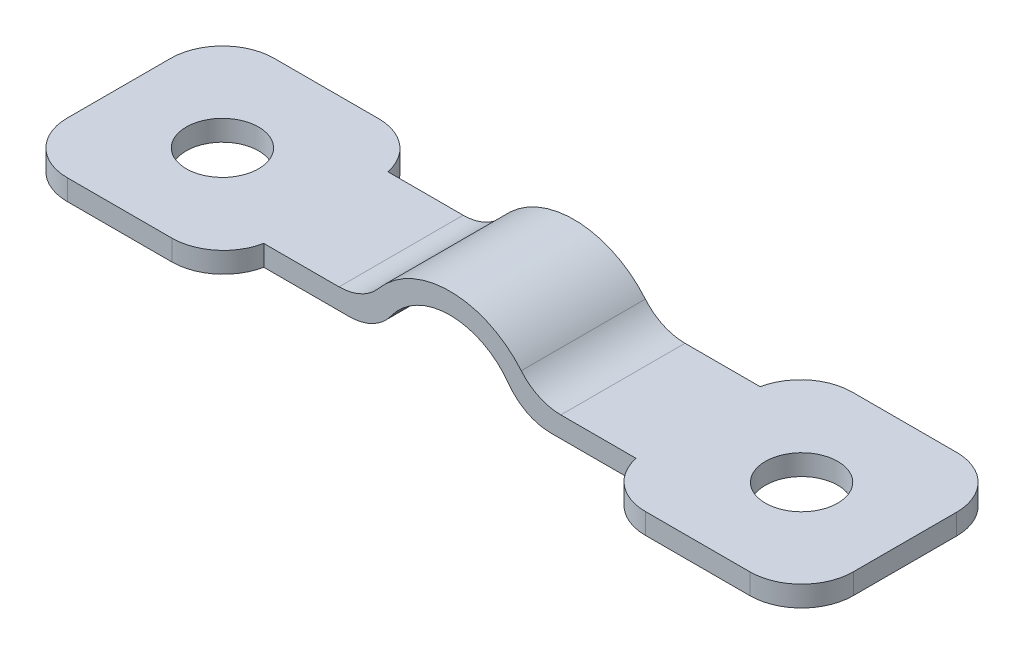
ISO-10303-21;
HEADER;
FILE_DESCRIPTION(('STEP AP214'),'2;1');
FILE_NAME('part.step','',(''),(''),'','','');
FILE_SCHEMA(('AUTOMOTIVE_DESIGN { 1 0 10303 214 1 1 1 1 }'));
ENDSEC;
DATA;
#1=APPLICATION_CONTEXT('core data for automotive mechanical design processes');
#2=APPLICATION_PROTOCOL_DEFINITION('international standard','automotive_design',2000,#1);
#3=PRODUCT_CONTEXT('',#1,'mechanical');
#4=PRODUCT('Part','Part','',(#3));
#5=PRODUCT_RELATED_PRODUCT_CATEGORY('part','',(#4));
#6=PRODUCT_DEFINITION_FORMATION('','',#4);
#7=PRODUCT_DEFINITION_CONTEXT('part definition',#1,'design');
#8=PRODUCT_DEFINITION('design','',#6,#7);
#9=PRODUCT_DEFINITION_SHAPE('','',#8);
#10=(LENGTH_UNIT() NAMED_UNIT(*) SI_UNIT(.MILLI.,.METRE.));
#11=(NAMED_UNIT(*) PLANE_ANGLE_UNIT() SI_UNIT($,.RADIAN.));
#12=(NAMED_UNIT(*) SI_UNIT($,.STERADIAN.) SOLID_ANGLE_UNIT());
#13=UNCERTAINTY_MEASURE_WITH_UNIT(LENGTH_MEASURE(1.E-05),#10,'distance_accuracy_value','');
#14=(GEOMETRIC_REPRESENTATION_CONTEXT(3) GLOBAL_UNCERTAINTY_ASSIGNED_CONTEXT((#13)) GLOBAL_UNIT_ASSIGNED_CONTEXT((#10,
#11,#12)) REPRESENTATION_CONTEXT('',''));
#15=CARTESIAN_POINT('',(0.,0.,0.));
#16=DIRECTION('',(0.,0.,1.));
#17=DIRECTION('',(1.,0.,0.));
#18=AXIS2_PLACEMENT_3D('',#15,#16,#17);
#19=CARTESIAN_POINT('',(0.,2.,10.));
#20=DIRECTION('',(0.,-1.,0.));
#21=DIRECTION('',(1.,0.,0.));
#22=AXIS2_PLACEMENT_3D('',#19,#20,#21);
#23=PLANE('',#22);
#24=CARTESIAN_POINT('',(-14.,1.99999999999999,5.));
#25=DIRECTION('',(0.,1.,0.));
#26=DIRECTION('',(-1.,0.,0.));
#27=AXIS2_PLACEMENT_3D('',#24,#25,#26);
#28=CIRCLE('',#27,1.75);
#29=CARTESIAN_POINT('',(-15.75,1.99999999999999,5.));
#30=VERTEX_POINT('',#29);
#31=EDGE_CURVE('E604',#30,#30,#28,.T.);
#32=ORIENTED_EDGE('',*,*,#31,.F.);
#33=EDGE_LOOP('',(#32));
#34=FACE_BOUND('',#33,.T.);
#35=DIRECTION('',(-1.,0.,0.));
#36=VECTOR('',#35,1.);
#37=CARTESIAN_POINT('',(0.,2.,10.));
#38=LINE('',#37,#36);
#39=CARTESIAN_POINT('',(-11.4494897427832,1.99999999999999,10.));
#40=VERTEX_POINT('',#39);
#41=CARTESIAN_POINT('',(-16.5,1.99999999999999,10.));
#42=VERTEX_POINT('',#41);
#43=EDGE_CURVE('E311',#40,#42,#38,.T.);
#44=ORIENTED_EDGE('',*,*,#43,.F.);
#45=CARTESIAN_POINT('',(-11.4494897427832,1.99999999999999,7.5));
#46=DIRECTION('',(0.,-1.,0.));
#47=DIRECTION('',(1.,0.,0.));
#48=AXIS2_PLACEMENT_3D('',#45,#46,#47);
#49=CIRCLE('',#48,2.5);
#50=CARTESIAN_POINT('',(-9.,1.99999999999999,8.));
#51=VERTEX_POINT('',#50);
#52=EDGE_CURVE('E89',#40,#51,#49,.F.);
#53=ORIENTED_EDGE('',*,*,#52,.T.);
#54=DIRECTION('',(-1.,0.,0.));
#55=VECTOR('',#54,1.);
#56=CARTESIAN_POINT('',(0.,2.,8.));
#57=LINE('',#56,#55);
#58=CARTESIAN_POINT('',(-5.36190264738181,1.99999999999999,8.));
#59=VERTEX_POINT('',#58);
#60=EDGE_CURVE('E292',#59,#51,#57,.T.);
#61=ORIENTED_EDGE('',*,*,#60,.F.);
#62=DIRECTION('',(0.,0.,1.));
#63=VECTOR('',#62,1.);
#64=CARTESIAN_POINT('',(-5.36190264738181,1.99999999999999,2.));
#65=LINE('',#64,#63);
#66=CARTESIAN_POINT('',(-5.36190264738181,1.99999999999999,2.));
#67=VERTEX_POINT('',#66);
#68=EDGE_CURVE('E460',#59,#67,#65,.F.);
#69=ORIENTED_EDGE('',*,*,#68,.T.);
#70=DIRECTION('',(-1.,0.,0.));
#71=VECTOR('',#70,1.);
#72=CARTESIAN_POINT('',(0.,2.,2.));
#73=LINE('',#72,#71);
#74=CARTESIAN_POINT('',(-9.,1.99999999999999,2.));
#75=VERTEX_POINT('',#74);
#76=EDGE_CURVE('E304',#67,#75,#73,.T.);
#77=ORIENTED_EDGE('',*,*,#76,.T.);
#78=CARTESIAN_POINT('',(-11.4494897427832,1.99999999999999,2.5));
#79=DIRECTION('',(0.,-1.,0.));
#80=DIRECTION('',(1.,0.,0.));
#81=AXIS2_PLACEMENT_3D('',#78,#79,#80);
#82=CIRCLE('',#81,2.5);
#83=CARTESIAN_POINT('',(-11.4494897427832,1.99999999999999,0.));
#84=VERTEX_POINT('',#83);
#85=EDGE_CURVE('E268',#75,#84,#82,.F.);
#86=ORIENTED_EDGE('',*,*,#85,.T.);
#87=DIRECTION('',(-1.,0.,0.));
#88=VECTOR('',#87,1.);
#89=CARTESIAN_POINT('',(0.,2.,0.));
#90=LINE('',#89,#88);
#91=CARTESIAN_POINT('',(-16.5,1.99999999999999,0.));
#92=VERTEX_POINT('',#91);
#93=EDGE_CURVE('E318',#84,#92,#90,.T.);
#94=ORIENTED_EDGE('',*,*,#93,.T.);
#95=CARTESIAN_POINT('',(-16.5,1.99999999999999,2.5));
#96=DIRECTION('',(0.,-1.,0.));
#97=DIRECTION('',(1.,0.,0.));
#98=AXIS2_PLACEMENT_3D('',#95,#96,#97);
#99=CIRCLE('',#98,2.5);
#100=CARTESIAN_POINT('',(-19.,1.99999999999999,2.5));
#101=VERTEX_POINT('',#100);
#102=EDGE_CURVE('E401',#92,#101,#99,.F.);
#103=ORIENTED_EDGE('',*,*,#102,.T.);
#104=DIRECTION('',(0.,0.,-1.));
#105=VECTOR('',#104,1.);
#106=CARTESIAN_POINT('',(-19.,1.99999999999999,10.));
#107=LINE('',#106,#105);
#108=CARTESIAN_POINT('',(-19.,1.99999999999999,7.5));
#109=VERTEX_POINT('',#108);
#110=EDGE_CURVE('E328',#109,#101,#107,.T.);
#111=ORIENTED_EDGE('',*,*,#110,.F.);
#112=CARTESIAN_POINT('',(-16.5,1.99999999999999,7.5));
#113=DIRECTION('',(0.,-1.,0.));
#114=DIRECTION('',(1.,0.,0.));
#115=AXIS2_PLACEMENT_3D('',#112,#113,#114);
#116=CIRCLE('',#115,2.5);
#117=EDGE_CURVE('E397',#109,#42,#116,.F.);
#118=ORIENTED_EDGE('',*,*,#117,.T.);
#119=EDGE_LOOP('',(#44,#53,#61,#69,#77,#86,#94,#103,#111,#118));
#120=FACE_BOUND('',#119,.T.);
#121=ADVANCED_FACE('F80',(#34,#120),#23,.F.);
#122=CARTESIAN_POINT('',(0.,0.999999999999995,10.));
#123=DIRECTION('',(0.,-1.,0.));
#124=DIRECTION('',(1.,0.,0.));
#125=AXIS2_PLACEMENT_3D('',#122,#123,#124);
#126=PLANE('',#125);
#127=CARTESIAN_POINT('',(-14.,0.999999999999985,5.));
#128=DIRECTION('',(0.,1.,0.));
#129=DIRECTION('',(-1.,0.,0.));
#130=AXIS2_PLACEMENT_3D('',#127,#128,#129);
#131=CIRCLE('',#130,1.75);
#132=CARTESIAN_POINT('',(-15.75,0.999999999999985,5.));
#133=VERTEX_POINT('',#132);
#134=EDGE_CURVE('E601',#133,#133,#131,.T.);
#135=ORIENTED_EDGE('',*,*,#134,.T.);
#136=EDGE_LOOP('',(#135));
#137=FACE_BOUND('',#136,.T.);
#138=DIRECTION('',(1.,0.,0.));
#139=VECTOR('',#138,1.);
#140=CARTESIAN_POINT('',(0.,0.99999999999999,8.));
#141=LINE('',#140,#139);
#142=CARTESIAN_POINT('',(-9.,0.999999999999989,8.));
#143=VERTEX_POINT('',#142);
#144=CARTESIAN_POINT('',(-4.87339717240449,0.99999999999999,8.));
#145=VERTEX_POINT('',#144);
#146=EDGE_CURVE('E277',#143,#145,#141,.T.);
#147=ORIENTED_EDGE('',*,*,#146,.F.);
#148=CARTESIAN_POINT('',(-11.4494897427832,0.999999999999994,7.5));
#149=DIRECTION('',(0.,-1.,0.));
#150=DIRECTION('',(1.,0.,0.));
#151=AXIS2_PLACEMENT_3D('',#148,#149,#150);
#152=CIRCLE('',#151,2.5);
#153=CARTESIAN_POINT('',(-11.4494897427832,0.999999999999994,10.));
#154=VERTEX_POINT('',#153);
#155=EDGE_CURVE('E12',#143,#154,#152,.T.);
#156=ORIENTED_EDGE('',*,*,#155,.T.);
#157=DIRECTION('',(-1.,0.,0.));
#158=VECTOR('',#157,1.);
#159=CARTESIAN_POINT('',(0.,0.999999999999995,10.));
#160=LINE('',#159,#158);
#161=CARTESIAN_POINT('',(-16.5,0.999999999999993,10.));
#162=VERTEX_POINT('',#161);
#163=EDGE_CURVE('E314',#154,#162,#160,.T.);
#164=ORIENTED_EDGE('',*,*,#163,.T.);
#165=CARTESIAN_POINT('',(-16.5,0.999999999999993,7.5));
#166=DIRECTION('',(0.,-1.,0.));
#167=DIRECTION('',(1.,0.,0.));
#168=AXIS2_PLACEMENT_3D('',#165,#166,#167);
#169=CIRCLE('',#168,2.5);
#170=CARTESIAN_POINT('',(-19.,0.999999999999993,7.5));
#171=VERTEX_POINT('',#170);
#172=EDGE_CURVE('E413',#162,#171,#169,.T.);
#173=ORIENTED_EDGE('',*,*,#172,.T.);
#174=DIRECTION('',(0.,0.,-1.));
#175=VECTOR('',#174,1.);
#176=CARTESIAN_POINT('',(-19.,0.999999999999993,10.));
#177=LINE('',#176,#175);
#178=CARTESIAN_POINT('',(-19.,0.999999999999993,2.5));
#179=VERTEX_POINT('',#178);
#180=EDGE_CURVE('E317',#171,#179,#177,.T.);
#181=ORIENTED_EDGE('',*,*,#180,.T.);
#182=CARTESIAN_POINT('',(-16.5,0.999999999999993,2.5));
#183=DIRECTION('',(0.,-1.,0.));
#184=DIRECTION('',(1.,0.,0.));
#185=AXIS2_PLACEMENT_3D('',#182,#183,#184);
#186=CIRCLE('',#185,2.5);
#187=CARTESIAN_POINT('',(-16.5,0.999999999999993,0.));
#188=VERTEX_POINT('',#187);
#189=EDGE_CURVE('E253',#179,#188,#186,.T.);
#190=ORIENTED_EDGE('',*,*,#189,.T.);
#191=DIRECTION('',(-1.,0.,0.));
#192=VECTOR('',#191,1.);
#193=CARTESIAN_POINT('',(0.,0.999999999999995,0.));
#194=LINE('',#193,#192);
#195=CARTESIAN_POINT('',(-11.4494897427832,0.999999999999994,0.));
#196=VERTEX_POINT('',#195);
#197=EDGE_CURVE('E247',#196,#188,#194,.T.);
#198=ORIENTED_EDGE('',*,*,#197,.F.);
#199=CARTESIAN_POINT('',(-11.4494897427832,0.999999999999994,2.5));
#200=DIRECTION('',(0.,-1.,0.));
#201=DIRECTION('',(1.,0.,0.));
#202=AXIS2_PLACEMENT_3D('',#199,#200,#201);
#203=CIRCLE('',#202,2.5);
#204=CARTESIAN_POINT('',(-9.,0.999999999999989,2.));
#205=VERTEX_POINT('',#204);
#206=EDGE_CURVE('E241',#196,#205,#203,.T.);
#207=ORIENTED_EDGE('',*,*,#206,.T.);
#208=DIRECTION('',(1.,0.,0.));
#209=VECTOR('',#208,1.);
#210=CARTESIAN_POINT('',(0.,0.99999999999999,2.));
#211=LINE('',#210,#209);
#212=CARTESIAN_POINT('',(-4.87339717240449,0.99999999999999,2.));
#213=VERTEX_POINT('',#212);
#214=EDGE_CURVE('E244',#205,#213,#211,.T.);
#215=ORIENTED_EDGE('',*,*,#214,.T.);
#216=DIRECTION('',(0.,0.,-1.));
#217=VECTOR('',#216,1.);
#218=CARTESIAN_POINT('',(-4.87339717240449,0.999999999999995,10.));
#219=LINE('',#218,#217);
#220=EDGE_CURVE('E464',#213,#145,#219,.F.);
#221=ORIENTED_EDGE('',*,*,#220,.T.);
#222=EDGE_LOOP('',(#147,#156,#164,#173,#181,#190,#198,#207,#215,#221));
#223=FACE_BOUND('',#222,.T.);
#224=ADVANCED_FACE('F243',(#137,#223),#126,.T.);
#225=CARTESIAN_POINT('',(0.,0.,10.));
#226=DIRECTION('',(0.,0.,-1.));
#227=DIRECTION('',(-1.,0.,0.));
#228=AXIS2_PLACEMENT_3D('',#225,#226,#227);
#229=CYLINDRICAL_SURFACE('',#228,3.5);
#230=CARTESIAN_POINT('',(0.,0.,2.));
#231=DIRECTION('',(0.,0.,1.));
#232=DIRECTION('',(1.,0.,0.));
#233=AXIS2_PLACEMENT_3D('',#230,#231,#232);
#234=CIRCLE('',#233,3.5);
#235=CARTESIAN_POINT('',(2.84281501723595,2.04166666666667,2.));
#236=VERTEX_POINT('',#235);
#237=CARTESIAN_POINT('',(-2.84281501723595,2.04166666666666,2.));
#238=VERTEX_POINT('',#237);
#239=EDGE_CURVE('E307',#236,#238,#234,.T.);
#240=ORIENTED_EDGE('',*,*,#239,.F.);
#241=DIRECTION('',(0.,0.,-1.));
#242=VECTOR('',#241,1.);
#243=CARTESIAN_POINT('',(2.84281501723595,2.04166666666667,10.));
#244=LINE('',#243,#242);
#245=CARTESIAN_POINT('',(2.84281501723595,2.04166666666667,8.));
#246=VERTEX_POINT('',#245);
#247=EDGE_CURVE('E441',#236,#246,#244,.F.);
#248=ORIENTED_EDGE('',*,*,#247,.T.);
#249=CARTESIAN_POINT('',(0.,0.,8.));
#250=DIRECTION('',(0.,0.,1.));
#251=DIRECTION('',(1.,0.,0.));
#252=AXIS2_PLACEMENT_3D('',#249,#250,#251);
#253=CIRCLE('',#252,3.5);
#254=CARTESIAN_POINT('',(-2.84281501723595,2.04166666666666,8.));
#255=VERTEX_POINT('',#254);
#256=EDGE_CURVE('E296',#246,#255,#253,.T.);
#257=ORIENTED_EDGE('',*,*,#256,.T.);
#258=DIRECTION('',(0.,0.,-1.));
#259=VECTOR('',#258,1.);
#260=CARTESIAN_POINT('',(-2.84281501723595,2.04166666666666,10.));
#261=LINE('',#260,#259);
#262=EDGE_CURVE('E437',#255,#238,#261,.T.);
#263=ORIENTED_EDGE('',*,*,#262,.T.);
#264=EDGE_LOOP('',(#240,#248,#257,#263));
#265=FACE_BOUND('',#264,.T.);
#266=ADVANCED_FACE('F546',(#265),#229,.F.);
#267=CARTESIAN_POINT('',(0.,0.,10.));
#268=DIRECTION('',(0.,0.,-1.));
#269=DIRECTION('',(-1.,0.,0.));
#270=AXIS2_PLACEMENT_3D('',#267,#268,#269);
#271=CYLINDRICAL_SURFACE('',#270,4.5);
#272=CARTESIAN_POINT('',(0.,0.,8.));
#273=DIRECTION('',(0.,0.,1.));
#274=DIRECTION('',(1.,0.,0.));
#275=AXIS2_PLACEMENT_3D('',#272,#273,#274);
#276=CIRCLE('',#275,4.5);
#277=CARTESIAN_POINT('',(3.44693741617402,2.89285714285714,8.));
#278=VERTEX_POINT('',#277);
#279=CARTESIAN_POINT('',(-3.44693741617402,2.89285714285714,8.));
#280=VERTEX_POINT('',#279);
#281=EDGE_CURVE('E274',#278,#280,#276,.T.);
#282=ORIENTED_EDGE('',*,*,#281,.F.);
#283=DIRECTION('',(0.,0.,-1.));
#284=VECTOR('',#283,1.);
#285=CARTESIAN_POINT('',(3.44693741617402,2.89285714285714,10.));
#286=LINE('',#285,#284);
#287=CARTESIAN_POINT('',(3.44693741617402,2.89285714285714,2.));
#288=VERTEX_POINT('',#287);
#289=EDGE_CURVE('E453',#278,#288,#286,.T.);
#290=ORIENTED_EDGE('',*,*,#289,.T.);
#291=CARTESIAN_POINT('',(0.,0.,2.));
#292=DIRECTION('',(0.,0.,1.));
#293=DIRECTION('',(1.,0.,0.));
#294=AXIS2_PLACEMENT_3D('',#291,#292,#293);
#295=CIRCLE('',#294,4.5);
#296=CARTESIAN_POINT('',(-3.44693741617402,2.89285714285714,2.));
#297=VERTEX_POINT('',#296);
#298=EDGE_CURVE('E300',#288,#297,#295,.T.);
#299=ORIENTED_EDGE('',*,*,#298,.T.);
#300=DIRECTION('',(0.,0.,-1.));
#301=VECTOR('',#300,1.);
#302=CARTESIAN_POINT('',(-3.44693741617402,2.89285714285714,10.));
#303=LINE('',#302,#301);
#304=EDGE_CURVE('E450',#297,#280,#303,.F.);
#305=ORIENTED_EDGE('',*,*,#304,.T.);
#306=EDGE_LOOP('',(#282,#290,#299,#305));
#307=FACE_BOUND('',#306,.T.);
#308=ADVANCED_FACE('F523',(#307),#271,.T.);
#309=CARTESIAN_POINT('',(0.,0.,0.));
#310=DIRECTION('',(0.,0.,1.));
#311=DIRECTION('',(1.,0.,0.));
#312=AXIS2_PLACEMENT_3D('',#309,#310,#311);
#313=PLANE('',#312);
#314=ORIENTED_EDGE('',*,*,#93,.F.);
#315=DIRECTION('',(0.,-1.,0.));
#316=VECTOR('',#315,1.);
#317=CARTESIAN_POINT('',(-11.4494897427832,0.,0.));
#318=LINE('',#317,#316);
#319=EDGE_CURVE('E410',#84,#196,#318,.T.);
#320=ORIENTED_EDGE('',*,*,#319,.T.);
#321=ORIENTED_EDGE('',*,*,#197,.T.);
#322=DIRECTION('',(0.,1.,0.));
#323=VECTOR('',#322,1.);
#324=CARTESIAN_POINT('',(-16.5,1.99999999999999,0.));
#325=LINE('',#324,#323);
#326=EDGE_CURVE('E406',#188,#92,#325,.T.);
#327=ORIENTED_EDGE('',*,*,#326,.T.);
#328=EDGE_LOOP('',(#314,#320,#321,#327));
#329=FACE_BOUND('',#328,.T.);
#330=ADVANCED_FACE('F517',(#329),#313,.F.);
#331=CARTESIAN_POINT('',(0.,0.,10.));
#332=DIRECTION('',(0.,0.,1.));
#333=DIRECTION('',(1.,0.,0.));
#334=AXIS2_PLACEMENT_3D('',#331,#332,#333);
#335=PLANE('',#334);
#336=ORIENTED_EDGE('',*,*,#163,.F.);
#337=DIRECTION('',(0.,1.,0.));
#338=VECTOR('',#337,1.);
#339=CARTESIAN_POINT('',(-11.4494897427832,1.99999999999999,10.));
#340=LINE('',#339,#338);
#341=EDGE_CURVE('E488',#154,#40,#340,.T.);
#342=ORIENTED_EDGE('',*,*,#341,.T.);
#343=ORIENTED_EDGE('',*,*,#43,.T.);
#344=DIRECTION('',(0.,1.,0.));
#345=VECTOR('',#344,1.);
#346=CARTESIAN_POINT('',(-16.5,0.,10.));
#347=LINE('',#346,#345);
#348=EDGE_CURVE('E424',#42,#162,#347,.F.);
#349=ORIENTED_EDGE('',*,*,#348,.T.);
#350=EDGE_LOOP('',(#336,#342,#343,#349));
#351=FACE_BOUND('',#350,.T.);
#352=ADVANCED_FACE('F500',(#351),#335,.T.);
#353=CARTESIAN_POINT('',(3.35410196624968,1.,10.));
#354=DIRECTION('',(0.,1.,0.));
#355=DIRECTION('',(0.,0.,1.));
#356=AXIS2_PLACEMENT_3D('',#353,#354,#355);
#357=PLANE('',#356);
#358=CARTESIAN_POINT('',(14.,0.999999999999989,5.));
#359=DIRECTION('',(0.,1.,0.));
#360=DIRECTION('',(-1.,0.,0.));
#361=AXIS2_PLACEMENT_3D('',#358,#359,#360);
#362=CIRCLE('',#361,1.75);
#363=CARTESIAN_POINT('',(12.25,0.999999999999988,5.));
#364=VERTEX_POINT('',#363);
#365=EDGE_CURVE('E615',#364,#364,#362,.T.);
#366=ORIENTED_EDGE('',*,*,#365,.T.);
#367=EDGE_LOOP('',(#366));
#368=FACE_BOUND('',#367,.T.);
#369=DIRECTION('',(1.,0.,0.));
#370=VECTOR('',#369,1.);
#371=CARTESIAN_POINT('',(3.35410196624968,1.,10.));
#372=LINE('',#371,#370);
#373=CARTESIAN_POINT('',(11.4494897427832,1.,10.));
#374=VERTEX_POINT('',#373);
#375=CARTESIAN_POINT('',(16.5,1.,10.));
#376=VERTEX_POINT('',#375);
#377=EDGE_CURVE('E336',#374,#376,#372,.T.);
#378=ORIENTED_EDGE('',*,*,#377,.F.);
#379=CARTESIAN_POINT('',(11.4494897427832,1.,7.5));
#380=DIRECTION('',(0.,1.,0.));
#381=DIRECTION('',(0.,0.,1.));
#382=AXIS2_PLACEMENT_3D('',#379,#380,#381);
#383=CIRCLE('',#382,2.5);
#384=CARTESIAN_POINT('',(9.,0.999999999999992,8.));
#385=VERTEX_POINT('',#384);
#386=EDGE_CURVE('E485',#374,#385,#383,.F.);
#387=ORIENTED_EDGE('',*,*,#386,.T.);
#388=CARTESIAN_POINT('',(4.87339717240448,0.999999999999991,8.));
#389=VERTEX_POINT('',#388);
#390=EDGE_CURVE('E282',#389,#385,#141,.T.);
#391=ORIENTED_EDGE('',*,*,#390,.F.);
#392=DIRECTION('',(0.,0.,1.));
#393=VECTOR('',#392,1.);
#394=CARTESIAN_POINT('',(4.87339717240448,1.,2.));
#395=LINE('',#394,#393);
#396=CARTESIAN_POINT('',(4.87339717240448,0.999999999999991,2.));
#397=VERTEX_POINT('',#396);
#398=EDGE_CURVE('E428',#389,#397,#395,.F.);
#399=ORIENTED_EDGE('',*,*,#398,.T.);
#400=CARTESIAN_POINT('',(9.,0.999999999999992,2.));
#401=VERTEX_POINT('',#400);
#402=EDGE_CURVE('E264',#397,#401,#211,.T.);
#403=ORIENTED_EDGE('',*,*,#402,.T.);
#404=CARTESIAN_POINT('',(11.4494897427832,1.,2.5));
#405=DIRECTION('',(0.,1.,0.));
#406=DIRECTION('',(0.,0.,1.));
#407=AXIS2_PLACEMENT_3D('',#404,#405,#406);
#408=CIRCLE('',#407,2.5);
#409=CARTESIAN_POINT('',(11.4494897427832,1.,0.));
#410=VERTEX_POINT('',#409);
#411=EDGE_CURVE('E380',#401,#410,#408,.F.);
#412=ORIENTED_EDGE('',*,*,#411,.T.);
#413=DIRECTION('',(1.,0.,0.));
#414=VECTOR('',#413,1.);
#415=CARTESIAN_POINT('',(3.35410196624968,1.,0.));
#416=LINE('',#415,#414);
#417=CARTESIAN_POINT('',(16.5,1.,0.));
#418=VERTEX_POINT('',#417);
#419=EDGE_CURVE('E337',#410,#418,#416,.T.);
#420=ORIENTED_EDGE('',*,*,#419,.T.);
#421=CARTESIAN_POINT('',(16.5,1.,2.5));
#422=DIRECTION('',(0.,1.,0.));
#423=DIRECTION('',(0.,0.,1.));
#424=AXIS2_PLACEMENT_3D('',#421,#422,#423);
#425=CIRCLE('',#424,2.5);
#426=CARTESIAN_POINT('',(19.,1.,2.5));
#427=VERTEX_POINT('',#426);
#428=EDGE_CURVE('E383',#418,#427,#425,.F.);
#429=ORIENTED_EDGE('',*,*,#428,.T.);
#430=DIRECTION('',(0.,0.,-1.));
#431=VECTOR('',#430,1.);
#432=CARTESIAN_POINT('',(19.,1.,10.));
#433=LINE('',#432,#431);
#434=CARTESIAN_POINT('',(19.,1.,7.5));
#435=VERTEX_POINT('',#434);
#436=EDGE_CURVE('E322',#435,#427,#433,.T.);
#437=ORIENTED_EDGE('',*,*,#436,.F.);
#438=CARTESIAN_POINT('',(16.5,1.,7.5));
#439=DIRECTION('',(0.,1.,0.));
#440=DIRECTION('',(0.,0.,1.));
#441=AXIS2_PLACEMENT_3D('',#438,#439,#440);
#442=CIRCLE('',#441,2.5);
#443=EDGE_CURVE('E386',#435,#376,#442,.F.);
#444=ORIENTED_EDGE('',*,*,#443,.T.);
#445=EDGE_LOOP('',(#378,#387,#391,#399,#403,#412,#420,#429,#437,#444));
#446=FACE_BOUND('',#445,.T.);
#447=ADVANCED_FACE('F554',(#368,#446),#357,.F.);
#448=CARTESIAN_POINT('',(3.35410196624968,2.,10.));
#449=DIRECTION('',(0.,1.,0.));
#450=DIRECTION('',(0.,0.,1.));
#451=AXIS2_PLACEMENT_3D('',#448,#449,#450);
#452=PLANE('',#451);
#453=CARTESIAN_POINT('',(14.,2.,5.));
#454=DIRECTION('',(0.,1.,0.));
#455=DIRECTION('',(-1.,0.,0.));
#456=AXIS2_PLACEMENT_3D('',#453,#454,#455);
#457=CIRCLE('',#456,1.75);
#458=CARTESIAN_POINT('',(12.25,2.,5.));
#459=VERTEX_POINT('',#458);
#460=EDGE_CURVE('E609',#459,#459,#457,.T.);
#461=ORIENTED_EDGE('',*,*,#460,.F.);
#462=EDGE_LOOP('',(#461));
#463=FACE_BOUND('',#462,.T.);
#464=DIRECTION('',(1.,0.,0.));
#465=VECTOR('',#464,1.);
#466=CARTESIAN_POINT('',(3.35410196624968,2.,8.));
#467=LINE('',#466,#465);
#468=CARTESIAN_POINT('',(5.3619026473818,2.,8.));
#469=VERTEX_POINT('',#468);
#470=CARTESIAN_POINT('',(9.,2.,8.));
#471=VERTEX_POINT('',#470);
#472=EDGE_CURVE('E332',#469,#471,#467,.T.);
#473=ORIENTED_EDGE('',*,*,#472,.T.);
#474=CARTESIAN_POINT('',(11.4494897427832,2.,7.5));
#475=DIRECTION('',(0.,1.,0.));
#476=DIRECTION('',(0.,0.,1.));
#477=AXIS2_PLACEMENT_3D('',#474,#475,#476);
#478=CIRCLE('',#477,2.5);
#479=CARTESIAN_POINT('',(11.4494897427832,2.,10.));
#480=VERTEX_POINT('',#479);
#481=EDGE_CURVE('E479',#471,#480,#478,.T.);
#482=ORIENTED_EDGE('',*,*,#481,.T.);
#483=DIRECTION('',(1.,0.,0.));
#484=VECTOR('',#483,1.);
#485=CARTESIAN_POINT('',(3.35410196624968,2.,10.));
#486=LINE('',#485,#484);
#487=CARTESIAN_POINT('',(16.5,2.,10.));
#488=VERTEX_POINT('',#487);
#489=EDGE_CURVE('E333',#480,#488,#486,.T.);
#490=ORIENTED_EDGE('',*,*,#489,.T.);
#491=CARTESIAN_POINT('',(16.5,2.,7.5));
#492=DIRECTION('',(0.,1.,0.));
#493=DIRECTION('',(0.,0.,1.));
#494=AXIS2_PLACEMENT_3D('',#491,#492,#493);
#495=CIRCLE('',#494,2.5);
#496=CARTESIAN_POINT('',(19.,2.,7.5));
#497=VERTEX_POINT('',#496);
#498=EDGE_CURVE('E370',#488,#497,#495,.T.);
#499=ORIENTED_EDGE('',*,*,#498,.T.);
#500=DIRECTION('',(0.,0.,-1.));
#501=VECTOR('',#500,1.);
#502=CARTESIAN_POINT('',(19.,2.,10.));
#503=LINE('',#502,#501);
#504=CARTESIAN_POINT('',(19.,2.,2.5));
#505=VERTEX_POINT('',#504);
#506=EDGE_CURVE('E340',#497,#505,#503,.T.);
#507=ORIENTED_EDGE('',*,*,#506,.T.);
#508=CARTESIAN_POINT('',(16.5,2.,2.5));
#509=DIRECTION('',(0.,1.,0.));
#510=DIRECTION('',(0.,0.,1.));
#511=AXIS2_PLACEMENT_3D('',#508,#509,#510);
#512=CIRCLE('',#511,2.5);
#513=CARTESIAN_POINT('',(16.5,2.,0.));
#514=VERTEX_POINT('',#513);
#515=EDGE_CURVE('E367',#505,#514,#512,.T.);
#516=ORIENTED_EDGE('',*,*,#515,.T.);
#517=DIRECTION('',(1.,0.,0.));
#518=VECTOR('',#517,1.);
#519=CARTESIAN_POINT('',(3.35410196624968,2.,0.));
#520=LINE('',#519,#518);
#521=CARTESIAN_POINT('',(11.4494897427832,2.,0.));
#522=VERTEX_POINT('',#521);
#523=EDGE_CURVE('E310',#522,#514,#520,.T.);
#524=ORIENTED_EDGE('',*,*,#523,.F.);
#525=CARTESIAN_POINT('',(11.4494897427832,2.,2.5));
#526=DIRECTION('',(0.,1.,0.));
#527=DIRECTION('',(0.,0.,1.));
#528=AXIS2_PLACEMENT_3D('',#525,#526,#527);
#529=CIRCLE('',#528,2.5);
#530=CARTESIAN_POINT('',(9.,2.,2.));
#531=VERTEX_POINT('',#530);
#532=EDGE_CURVE('E363',#522,#531,#529,.T.);
#533=ORIENTED_EDGE('',*,*,#532,.T.);
#534=DIRECTION('',(1.,0.,0.));
#535=VECTOR('',#534,1.);
#536=CARTESIAN_POINT('',(3.35410196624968,2.,2.));
#537=LINE('',#536,#535);
#538=CARTESIAN_POINT('',(5.3619026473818,2.,2.));
#539=VERTEX_POINT('',#538);
#540=EDGE_CURVE('E356',#539,#531,#537,.T.);
#541=ORIENTED_EDGE('',*,*,#540,.F.);
#542=DIRECTION('',(0.,0.,-1.));
#543=VECTOR('',#542,1.);
#544=CARTESIAN_POINT('',(5.3619026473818,2.,10.));
#545=LINE('',#544,#543);
#546=EDGE_CURVE('E457',#539,#469,#545,.F.);
#547=ORIENTED_EDGE('',*,*,#546,.T.);
#548=EDGE_LOOP('',(#473,#482,#490,#499,#507,#516,#524,#533,#541,#547));
#549=FACE_BOUND('',#548,.T.);
#550=ADVANCED_FACE('F557',(#463,#549),#452,.T.);
#551=CARTESIAN_POINT('',(-19.,0.,10.));
#552=DIRECTION('',(-1.,0.,0.));
#553=DIRECTION('',(0.,0.,1.));
#554=AXIS2_PLACEMENT_3D('',#551,#552,#553);
#555=PLANE('',#554);
#556=ORIENTED_EDGE('',*,*,#110,.T.);
#557=DIRECTION('',(0.,1.,0.));
#558=VECTOR('',#557,1.);
#559=CARTESIAN_POINT('',(-19.,0.999999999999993,2.5));
#560=LINE('',#559,#558);
#561=EDGE_CURVE('E421',#101,#179,#560,.F.);
#562=ORIENTED_EDGE('',*,*,#561,.T.);
#563=ORIENTED_EDGE('',*,*,#180,.F.);
#564=DIRECTION('',(0.,1.,0.));
#565=VECTOR('',#564,1.);
#566=CARTESIAN_POINT('',(-19.,0.,7.5));
#567=LINE('',#566,#565);
#568=EDGE_CURVE('E252',#171,#109,#567,.T.);
#569=ORIENTED_EDGE('',*,*,#568,.T.);
#570=EDGE_LOOP('',(#556,#562,#563,#569));
#571=FACE_BOUND('',#570,.T.);
#572=ADVANCED_FACE('F508',(#571),#555,.T.);
#573=ORIENTED_EDGE('',*,*,#523,.T.);
#574=DIRECTION('',(0.,1.,0.));
#575=VECTOR('',#574,1.);
#576=CARTESIAN_POINT('',(16.5,0.,0.));
#577=LINE('',#576,#575);
#578=EDGE_CURVE('E394',#514,#418,#577,.F.);
#579=ORIENTED_EDGE('',*,*,#578,.T.);
#580=ORIENTED_EDGE('',*,*,#419,.F.);
#581=DIRECTION('',(0.,-1.,0.));
#582=VECTOR('',#581,1.);
#583=CARTESIAN_POINT('',(11.4494897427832,0.,0.));
#584=LINE('',#583,#582);
#585=EDGE_CURVE('E390',#410,#522,#584,.F.);
#586=ORIENTED_EDGE('',*,*,#585,.T.);
#587=EDGE_LOOP('',(#573,#579,#580,#586));
#588=FACE_BOUND('',#587,.T.);
#589=ADVANCED_FACE('F645',(#588),#313,.F.);
#590=ORIENTED_EDGE('',*,*,#489,.F.);
#591=DIRECTION('',(0.,1.,0.));
#592=VECTOR('',#591,1.);
#593=CARTESIAN_POINT('',(11.4494897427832,0.999999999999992,10.));
#594=LINE('',#593,#592);
#595=EDGE_CURVE('E482',#480,#374,#594,.F.);
#596=ORIENTED_EDGE('',*,*,#595,.T.);
#597=ORIENTED_EDGE('',*,*,#377,.T.);
#598=DIRECTION('',(0.,1.,0.));
#599=VECTOR('',#598,1.);
#600=CARTESIAN_POINT('',(16.5,1.99999999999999,10.));
#601=LINE('',#600,#599);
#602=EDGE_CURVE('E359',#376,#488,#601,.T.);
#603=ORIENTED_EDGE('',*,*,#602,.T.);
#604=EDGE_LOOP('',(#590,#596,#597,#603));
#605=FACE_BOUND('',#604,.T.);
#606=ADVANCED_FACE('F562',(#605),#335,.T.);
#607=CARTESIAN_POINT('',(19.,1.,10.));
#608=DIRECTION('',(-1.,0.,0.));
#609=DIRECTION('',(0.,-1.,0.));
#610=AXIS2_PLACEMENT_3D('',#607,#608,#609);
#611=PLANE('',#610);
#612=ORIENTED_EDGE('',*,*,#506,.F.);
#613=DIRECTION('',(0.,1.,0.));
#614=VECTOR('',#613,1.);
#615=CARTESIAN_POINT('',(19.,1.,7.5));
#616=LINE('',#615,#614);
#617=EDGE_CURVE('E377',#497,#435,#616,.F.);
#618=ORIENTED_EDGE('',*,*,#617,.T.);
#619=ORIENTED_EDGE('',*,*,#436,.T.);
#620=DIRECTION('',(0.,1.,0.));
#621=VECTOR('',#620,1.);
#622=CARTESIAN_POINT('',(19.,1.,2.5));
#623=LINE('',#622,#621);
#624=EDGE_CURVE('E373',#427,#505,#623,.T.);
#625=ORIENTED_EDGE('',*,*,#624,.T.);
#626=EDGE_LOOP('',(#612,#618,#619,#625));
#627=FACE_BOUND('',#626,.T.);
#628=ADVANCED_FACE('F559',(#627),#611,.F.);
#629=CARTESIAN_POINT('',(0.,0.99999999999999,8.));
#630=DIRECTION('',(0.,0.,1.));
#631=DIRECTION('',(1.,0.,0.));
#632=AXIS2_PLACEMENT_3D('',#629,#630,#631);
#633=PLANE('',#632);
#634=ORIENTED_EDGE('',*,*,#256,.F.);
#635=CARTESIAN_POINT('',(4.87339717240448,3.5,8.));
#636=DIRECTION('',(0.,0.,1.));
#637=DIRECTION('',(1.,0.,0.));
#638=AXIS2_PLACEMENT_3D('',#635,#636,#637);
#639=CIRCLE('',#638,2.5);
#640=EDGE_CURVE('E447',#246,#389,#639,.T.);
#641=ORIENTED_EDGE('',*,*,#640,.T.);
#642=ORIENTED_EDGE('',*,*,#390,.T.);
#643=DIRECTION('',(0.,1.,0.));
#644=VECTOR('',#643,1.);
#645=CARTESIAN_POINT('',(9.,0.999999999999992,8.));
#646=LINE('',#645,#644);
#647=EDGE_CURVE('E283',#385,#471,#646,.T.);
#648=ORIENTED_EDGE('',*,*,#647,.T.);
#649=ORIENTED_EDGE('',*,*,#472,.F.);
#650=CARTESIAN_POINT('',(5.3619026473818,4.5,8.));
#651=DIRECTION('',(0.,0.,1.));
#652=DIRECTION('',(1.,0.,0.));
#653=AXIS2_PLACEMENT_3D('',#650,#651,#652);
#654=CIRCLE('',#653,2.5);
#655=EDGE_CURVE('E470',#469,#278,#654,.F.);
#656=ORIENTED_EDGE('',*,*,#655,.T.);
#657=ORIENTED_EDGE('',*,*,#281,.T.);
#658=CARTESIAN_POINT('',(-5.36190264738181,4.49999999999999,8.));
#659=DIRECTION('',(0.,0.,1.));
#660=DIRECTION('',(1.,0.,0.));
#661=AXIS2_PLACEMENT_3D('',#658,#659,#660);
#662=CIRCLE('',#661,2.5);
#663=EDGE_CURVE('E476',#280,#59,#662,.F.);
#664=ORIENTED_EDGE('',*,*,#663,.T.);
#665=ORIENTED_EDGE('',*,*,#60,.T.);
#666=DIRECTION('',(0.,1.,0.));
#667=VECTOR('',#666,1.);
#668=CARTESIAN_POINT('',(-9.,0.999999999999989,8.));
#669=LINE('',#668,#667);
#670=EDGE_CURVE('E281',#143,#51,#669,.T.);
#671=ORIENTED_EDGE('',*,*,#670,.F.);
#672=ORIENTED_EDGE('',*,*,#146,.T.);
#673=CARTESIAN_POINT('',(-4.87339717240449,3.49999999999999,8.));
#674=DIRECTION('',(0.,0.,1.));
#675=DIRECTION('',(1.,0.,0.));
#676=AXIS2_PLACEMENT_3D('',#673,#674,#675);
#677=CIRCLE('',#676,2.5);
#678=EDGE_CURVE('E444',#145,#255,#677,.T.);
#679=ORIENTED_EDGE('',*,*,#678,.T.);
#680=EDGE_LOOP('',(#634,#641,#642,#648,#649,#656,#657,#664,#665,#671,#672,#679));
#681=FACE_BOUND('',#680,.T.);
#682=ADVANCED_FACE('F497',(#681),#633,.T.);
#683=CARTESIAN_POINT('',(0.,0.99999999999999,2.));
#684=DIRECTION('',(0.,0.,1.));
#685=DIRECTION('',(1.,0.,0.));
#686=AXIS2_PLACEMENT_3D('',#683,#684,#685);
#687=PLANE('',#686);
#688=ORIENTED_EDGE('',*,*,#402,.F.);
#689=CARTESIAN_POINT('',(4.87339717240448,3.5,2.));
#690=DIRECTION('',(0.,0.,1.));
#691=DIRECTION('',(1.,0.,0.));
#692=AXIS2_PLACEMENT_3D('',#689,#690,#691);
#693=CIRCLE('',#692,2.5);
#694=EDGE_CURVE('E434',#397,#236,#693,.F.);
#695=ORIENTED_EDGE('',*,*,#694,.T.);
#696=ORIENTED_EDGE('',*,*,#239,.T.);
#697=CARTESIAN_POINT('',(-4.87339717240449,3.49999999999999,2.));
#698=DIRECTION('',(0.,0.,1.));
#699=DIRECTION('',(1.,0.,0.));
#700=AXIS2_PLACEMENT_3D('',#697,#698,#699);
#701=CIRCLE('',#700,2.5);
#702=EDGE_CURVE('E262',#238,#213,#701,.F.);
#703=ORIENTED_EDGE('',*,*,#702,.T.);
#704=ORIENTED_EDGE('',*,*,#214,.F.);
#705=DIRECTION('',(0.,1.,0.));
#706=VECTOR('',#705,1.);
#707=CARTESIAN_POINT('',(-9.,0.999999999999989,2.));
#708=LINE('',#707,#706);
#709=EDGE_CURVE('E260',#205,#75,#708,.T.);
#710=ORIENTED_EDGE('',*,*,#709,.T.);
#711=ORIENTED_EDGE('',*,*,#76,.F.);
#712=CARTESIAN_POINT('',(-5.36190264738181,4.49999999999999,2.));
#713=DIRECTION('',(0.,0.,1.));
#714=DIRECTION('',(1.,0.,0.));
#715=AXIS2_PLACEMENT_3D('',#712,#713,#714);
#716=CIRCLE('',#715,2.5);
#717=EDGE_CURVE('E473',#67,#297,#716,.T.);
#718=ORIENTED_EDGE('',*,*,#717,.T.);
#719=ORIENTED_EDGE('',*,*,#298,.F.);
#720=CARTESIAN_POINT('',(5.3619026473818,4.5,2.));
#721=DIRECTION('',(0.,0.,1.));
#722=DIRECTION('',(1.,0.,0.));
#723=AXIS2_PLACEMENT_3D('',#720,#721,#722);
#724=CIRCLE('',#723,2.5);
#725=EDGE_CURVE('E467',#288,#539,#724,.T.);
#726=ORIENTED_EDGE('',*,*,#725,.T.);
#727=ORIENTED_EDGE('',*,*,#540,.T.);
#728=DIRECTION('',(0.,1.,0.));
#729=VECTOR('',#728,1.);
#730=CARTESIAN_POINT('',(9.,0.999999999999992,2.));
#731=LINE('',#730,#729);
#732=EDGE_CURVE('E270',#401,#531,#731,.T.);
#733=ORIENTED_EDGE('',*,*,#732,.F.);
#734=EDGE_LOOP('',(#688,#695,#696,#703,#704,#710,#711,#718,#719,#726,#727,#733));
#735=FACE_BOUND('',#734,.T.);
#736=ADVANCED_FACE('F258',(#735),#687,.F.);
#737=CARTESIAN_POINT('',(14.,0.999999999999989,5.));
#738=DIRECTION('',(0.,1.,0.));
#739=DIRECTION('',(-1.,0.,0.));
#740=AXIS2_PLACEMENT_3D('',#737,#738,#739);
#741=CYLINDRICAL_SURFACE('',#740,1.75);
#742=ORIENTED_EDGE('',*,*,#365,.F.);
#743=EDGE_LOOP('',(#742));
#744=FACE_BOUND('',#743,.T.);
#745=ORIENTED_EDGE('',*,*,#460,.T.);
#746=EDGE_LOOP('',(#745));
#747=FACE_BOUND('',#746,.T.);
#748=ADVANCED_FACE('F620',(#744,#747),#741,.F.);
#749=CARTESIAN_POINT('',(-14.,0.999999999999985,5.));
#750=DIRECTION('',(0.,1.,0.));
#751=DIRECTION('',(-1.,0.,0.));
#752=AXIS2_PLACEMENT_3D('',#749,#750,#751);
#753=CYLINDRICAL_SURFACE('',#752,1.75);
#754=ORIENTED_EDGE('',*,*,#134,.F.);
#755=EDGE_LOOP('',(#754));
#756=FACE_BOUND('',#755,.T.);
#757=ORIENTED_EDGE('',*,*,#31,.T.);
#758=EDGE_LOOP('',(#757));
#759=FACE_BOUND('',#758,.T.);
#760=ADVANCED_FACE('F571',(#756,#759),#753,.F.);
#761=CARTESIAN_POINT('',(16.5,0.,7.5));
#762=DIRECTION('',(0.,-1.,0.));
#763=DIRECTION('',(1.,0.,0.));
#764=AXIS2_PLACEMENT_3D('',#761,#762,#763);
#765=CYLINDRICAL_SURFACE('',#764,2.5);
#766=ORIENTED_EDGE('',*,*,#443,.F.);
#767=ORIENTED_EDGE('',*,*,#617,.F.);
#768=ORIENTED_EDGE('',*,*,#498,.F.);
#769=ORIENTED_EDGE('',*,*,#602,.F.);
#770=EDGE_LOOP('',(#766,#767,#768,#769));
#771=FACE_BOUND('',#770,.T.);
#772=ADVANCED_FACE('F567',(#771),#765,.T.);
#773=CARTESIAN_POINT('',(16.5,0.999999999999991,2.5));
#774=DIRECTION('',(0.,1.,0.));
#775=DIRECTION('',(-1.,0.,0.));
#776=AXIS2_PLACEMENT_3D('',#773,#774,#775);
#777=CYLINDRICAL_SURFACE('',#776,2.5);
#778=ORIENTED_EDGE('',*,*,#428,.F.);
#779=ORIENTED_EDGE('',*,*,#578,.F.);
#780=ORIENTED_EDGE('',*,*,#515,.F.);
#781=ORIENTED_EDGE('',*,*,#624,.F.);
#782=EDGE_LOOP('',(#778,#779,#780,#781));
#783=FACE_BOUND('',#782,.T.);
#784=ADVANCED_FACE('F570',(#783),#777,.T.);
#785=CARTESIAN_POINT('',(11.4494897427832,0.999999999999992,2.5));
#786=DIRECTION('',(0.,-1.,0.));
#787=DIRECTION('',(1.,0.,0.));
#788=AXIS2_PLACEMENT_3D('',#785,#786,#787);
#789=CYLINDRICAL_SURFACE('',#788,2.5);
#790=ORIENTED_EDGE('',*,*,#411,.F.);
#791=ORIENTED_EDGE('',*,*,#732,.T.);
#792=ORIENTED_EDGE('',*,*,#532,.F.);
#793=ORIENTED_EDGE('',*,*,#585,.F.);
#794=EDGE_LOOP('',(#790,#791,#792,#793));
#795=FACE_BOUND('',#794,.T.);
#796=ADVANCED_FACE('F575',(#795),#789,.T.);
#797=CARTESIAN_POINT('',(-11.4494897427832,0.999999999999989,2.5));
#798=DIRECTION('',(0.,-1.,0.));
#799=DIRECTION('',(1.,0.,0.));
#800=AXIS2_PLACEMENT_3D('',#797,#798,#799);
#801=CYLINDRICAL_SURFACE('',#800,2.5);
#802=ORIENTED_EDGE('',*,*,#206,.F.);
#803=ORIENTED_EDGE('',*,*,#319,.F.);
#804=ORIENTED_EDGE('',*,*,#85,.F.);
#805=ORIENTED_EDGE('',*,*,#709,.F.);
#806=EDGE_LOOP('',(#802,#803,#804,#805));
#807=FACE_BOUND('',#806,.T.);
#808=ADVANCED_FACE('F267',(#807),#801,.T.);
#809=CARTESIAN_POINT('',(-16.5,0.,2.5));
#810=DIRECTION('',(0.,-1.,0.));
#811=DIRECTION('',(0.,0.,-1.));
#812=AXIS2_PLACEMENT_3D('',#809,#810,#811);
#813=CYLINDRICAL_SURFACE('',#812,2.5);
#814=ORIENTED_EDGE('',*,*,#189,.F.);
#815=ORIENTED_EDGE('',*,*,#561,.F.);
#816=ORIENTED_EDGE('',*,*,#102,.F.);
#817=ORIENTED_EDGE('',*,*,#326,.F.);
#818=EDGE_LOOP('',(#814,#815,#816,#817));
#819=FACE_BOUND('',#818,.T.);
#820=ADVANCED_FACE('F513',(#819),#813,.T.);
#821=CARTESIAN_POINT('',(-16.5,0.,7.5));
#822=DIRECTION('',(0.,1.,0.));
#823=DIRECTION('',(0.,0.,1.));
#824=AXIS2_PLACEMENT_3D('',#821,#822,#823);
#825=CYLINDRICAL_SURFACE('',#824,2.5);
#826=ORIENTED_EDGE('',*,*,#172,.F.);
#827=ORIENTED_EDGE('',*,*,#348,.F.);
#828=ORIENTED_EDGE('',*,*,#117,.F.);
#829=ORIENTED_EDGE('',*,*,#568,.F.);
#830=EDGE_LOOP('',(#826,#827,#828,#829));
#831=FACE_BOUND('',#830,.T.);
#832=ADVANCED_FACE('F511',(#831),#825,.T.);
#833=CARTESIAN_POINT('',(4.87339717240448,3.5,10.));
#834=DIRECTION('',(0.,0.,-1.));
#835=DIRECTION('',(-1.,0.,0.));
#836=AXIS2_PLACEMENT_3D('',#833,#834,#835);
#837=CYLINDRICAL_SURFACE('',#836,2.5);
#838=ORIENTED_EDGE('',*,*,#640,.F.);
#839=ORIENTED_EDGE('',*,*,#247,.F.);
#840=ORIENTED_EDGE('',*,*,#694,.F.);
#841=ORIENTED_EDGE('',*,*,#398,.F.);
#842=EDGE_LOOP('',(#838,#839,#840,#841));
#843=FACE_BOUND('',#842,.T.);
#844=ADVANCED_FACE('F537',(#843),#837,.T.);
#845=CARTESIAN_POINT('',(5.3619026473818,4.5,10.));
#846=DIRECTION('',(0.,0.,-1.));
#847=DIRECTION('',(-1.,0.,0.));
#848=AXIS2_PLACEMENT_3D('',#845,#846,#847);
#849=CYLINDRICAL_SURFACE('',#848,2.5);
#850=ORIENTED_EDGE('',*,*,#655,.F.);
#851=ORIENTED_EDGE('',*,*,#546,.F.);
#852=ORIENTED_EDGE('',*,*,#725,.F.);
#853=ORIENTED_EDGE('',*,*,#289,.F.);
#854=EDGE_LOOP('',(#850,#851,#852,#853));
#855=FACE_BOUND('',#854,.T.);
#856=ADVANCED_FACE('F528',(#855),#849,.F.);
#857=CARTESIAN_POINT('',(-5.36190264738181,4.49999999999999,10.));
#858=DIRECTION('',(0.,0.,-1.));
#859=DIRECTION('',(-1.,0.,0.));
#860=AXIS2_PLACEMENT_3D('',#857,#858,#859);
#861=CYLINDRICAL_SURFACE('',#860,2.5);
#862=ORIENTED_EDGE('',*,*,#663,.F.);
#863=ORIENTED_EDGE('',*,*,#304,.F.);
#864=ORIENTED_EDGE('',*,*,#717,.F.);
#865=ORIENTED_EDGE('',*,*,#68,.F.);
#866=EDGE_LOOP('',(#862,#863,#864,#865));
#867=FACE_BOUND('',#866,.T.);
#868=ADVANCED_FACE('F525',(#867),#861,.F.);
#869=CARTESIAN_POINT('',(-4.87339717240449,3.49999999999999,10.));
#870=DIRECTION('',(0.,0.,-1.));
#871=DIRECTION('',(-1.,0.,0.));
#872=AXIS2_PLACEMENT_3D('',#869,#870,#871);
#873=CYLINDRICAL_SURFACE('',#872,2.5);
#874=ORIENTED_EDGE('',*,*,#678,.F.);
#875=ORIENTED_EDGE('',*,*,#220,.F.);
#876=ORIENTED_EDGE('',*,*,#702,.F.);
#877=ORIENTED_EDGE('',*,*,#262,.F.);
#878=EDGE_LOOP('',(#874,#875,#876,#877));
#879=FACE_BOUND('',#878,.T.);
#880=ADVANCED_FACE('F527',(#879),#873,.T.);
#881=CARTESIAN_POINT('',(11.4494897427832,0.999999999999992,7.5));
#882=DIRECTION('',(0.,-1.,0.));
#883=DIRECTION('',(1.,0.,0.));
#884=AXIS2_PLACEMENT_3D('',#881,#882,#883);
#885=CYLINDRICAL_SURFACE('',#884,2.5);
#886=ORIENTED_EDGE('',*,*,#386,.F.);
#887=ORIENTED_EDGE('',*,*,#595,.F.);
#888=ORIENTED_EDGE('',*,*,#481,.F.);
#889=ORIENTED_EDGE('',*,*,#647,.F.);
#890=EDGE_LOOP('',(#886,#887,#888,#889));
#891=FACE_BOUND('',#890,.T.);
#892=ADVANCED_FACE('F534',(#891),#885,.T.);
#893=CARTESIAN_POINT('',(-11.4494897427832,0.999999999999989,7.5));
#894=DIRECTION('',(0.,-1.,0.));
#895=DIRECTION('',(1.,0.,0.));
#896=AXIS2_PLACEMENT_3D('',#893,#894,#895);
#897=CYLINDRICAL_SURFACE('',#896,2.5);
#898=ORIENTED_EDGE('',*,*,#155,.F.);
#899=ORIENTED_EDGE('',*,*,#670,.T.);
#900=ORIENTED_EDGE('',*,*,#52,.F.);
#901=ORIENTED_EDGE('',*,*,#341,.F.);
#902=EDGE_LOOP('',(#898,#899,#900,#901));
#903=FACE_BOUND('',#902,.T.);
#904=ADVANCED_FACE('F82',(#903),#897,.T.);
#905=CLOSED_SHELL('',(#121,#224,#266,#308,#330,#352,#447,#550,#572,#589,#606,#628,#682,#736,
#748,#760,#772,#784,#796,#808,#820,#832,#844,#856,#868,#880,#892,#904));
#906=MANIFOLD_SOLID_BREP('B2',#905);
#907=ADVANCED_BREP_SHAPE_REPRESENTATION('',(#18,#906),#14);
#908=SHAPE_DEFINITION_REPRESENTATION(#9,#907);
ENDSEC;
END-ISO-10303-21;
